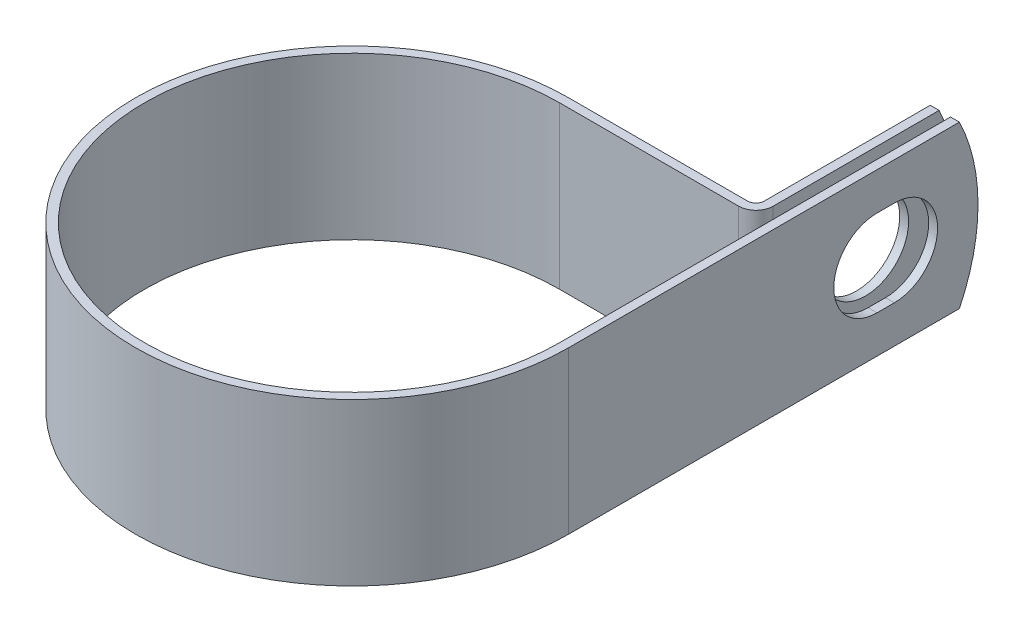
from build123d import *

# Parameters (mm, degrees)
EXTRUDE_THIN1_DEPTH = 11.1125
SKETCH2_R           = 5.9436
CUT_EXTRUDE1_DEPTH  = 1.2192
CUT_EXTRUDE2_REACH  = 84.754
CUT_EXTRUDE3_DEPTH  = 80.912268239


with BuildPart() as part:
    # Sketch1 → Extrude-Thin1 (new, symmetric)
    with BuildSketch(Plane(origin=(0, 0, 0), x_dir=(1, 0, 0), z_dir=(0, 1, 0))):
        with BuildLine():
            Line((28.575, 56.3372), (28.575, 28.575))
            Line((28.575, 28.575), (28.575, 0))
            ThreePointArc((28.575, 0), (-20.205576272, -20.205576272), (0, 28.575))
            Line((0, 28.575), (24.62276, 28.575))
            ThreePointArc((24.62276, 28.575), (26.303863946, 29.271336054), (27.0002, 30.95244))
            Line((27.0002, 30.95244), (27.0002, 56.3372))
            Line((27.0002, 56.3372), (25.781, 56.3372))
            Line((25.781, 56.3372), (25.781, 30.95244))
            ThreePointArc((25.781, 30.95244), (25.441759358, 30.133440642), (24.62276, 29.7942))
            Line((24.62276, 29.7942), (0, 29.7942))
            ThreePointArc((0, 29.7942), (-21.06768086, -21.06768086), (29.7942, 0))
            Line((29.7942, 0), (29.7942, 28.575))
            Line((29.7942, 28.575), (29.7942, 56.3372))
            Line((29.7942, 56.3372), (28.575, 56.3372))
        make_face()
    extrude(amount=EXTRUDE_THIN1_DEPTH, both=True)

    # Sketch2 → Cut-Extrude1 (cut)
    with BuildSketch(Plane.ZY.offset(-25.781)):
        with Locations((-43.6372, 0)):
            Circle(SKETCH2_R)
    extrude(amount=-CUT_EXTRUDE1_DEPTH, mode=Mode.SUBTRACT)

    # Sketch3 → Cut-Extrude2 (cut, up to next)
    with BuildSketch(Plane(origin=(29.7942, 0, 0), x_dir=(0, 0, -1), z_dir=(1, 0, 0)), mode=Mode.PRIVATE) as cut_extrude2_sk1:
        with BuildLine():
            Line((42.4434, 5.9436), (44.831, 5.9436))
            ThreePointArc((44.831, 5.9436), (50.7746, 0), (44.831, -5.9436))
            Line((44.831, -5.9436), (42.4434, -5.9436))
            ThreePointArc((42.4434, -5.9436), (36.4998, 0), (42.4434, 5.9436))
        make_face()
    cut_extrude2_tool1 = extrude(cut_extrude2_sk1.sketch, amount=-CUT_EXTRUDE2_REACH, mode=Mode.PRIVATE) & part.part
    add(cut_extrude2_tool1.solids().sort_by_distance((29.7942, 0, -43.6372))[0], mode=Mode.SUBTRACT)

    # Sketch4 → Cut-Extrude3 (cut, through all)
    with BuildSketch(Plane.ZY.offset(-25.781)):
        with BuildLine():
            Line((-53.77734763, 11.1125), (-56.3372, 11.1125))
            Line((-56.3372, 11.1125), (-56.3372, 1.46e-07))
            ThreePointArc((-56.3372, 1.46e-07), (-55.68896507, 5.701765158), (-53.77734763, 11.1125))
        make_face()
        with BuildLine():
            ThreePointArc((-53.77734763, -11.1125), (-55.688965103, -5.701765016), (-56.3372, 1.46e-07))
            Line((-56.3372, 1.46e-07), (-56.3372, -11.1125))
            Line((-56.3372, -11.1125), (-53.77734763, -11.1125))
        make_face()
    extrude(amount=-CUT_EXTRUDE3_DEPTH, mode=Mode.SUBTRACT)


solid = part.part
